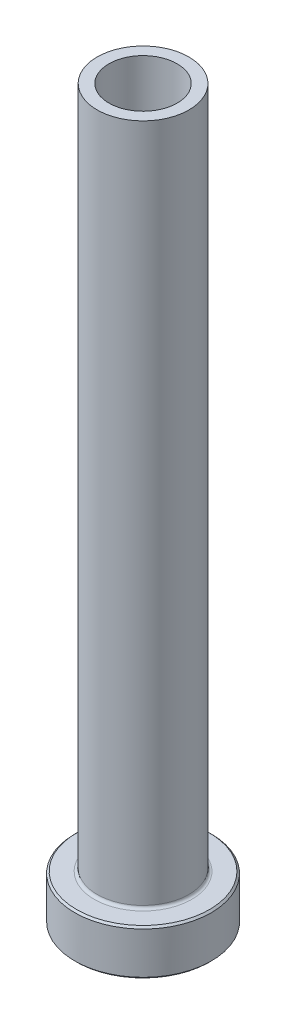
from build123d import *

# Parameters (mm, degrees)
CHAMFER1_SIZE = 0.254


with BuildPart() as part:
    # Sketch1 → Revolve1 (revolve)
    with BuildSketch(Plane.XY, mode=Mode.PRIVATE) as revolve1_sk:
        with BuildLine():
            Line((0, 0), (9.525, 0))
            Line((9.525, 0), (9.525, 6.35))
            Line((9.525, 6.35), (6.804025, 6.35))
            ThreePointArc((6.804025, 6.35), (6.523391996, 6.466241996), (6.40715, 6.746875))
            Line((6.40715, 6.746875), (6.40715, 101.6))
            Line((6.40715, 101.6), (0, 101.6))
            Line((0, 101.6), (0, 0))
        make_face()
    revolve(revolve1_sk.sketch.rotate(Axis((0, 0, 0), (0, 1, 0)), 90), axis=Axis((0, 0, 0), (0, 1, 0)))

    # Sketch2 → Cut-Revolve1 (revolve, cut)
    with BuildSketch(Plane.XY, mode=Mode.PRIVATE) as cut_revolve1_sk:
        Polygon((5.349875, 0), (4.953, 0.396875), (4.953, 27.1145), (4.7625, 41.402), (4.7625, 101.6), (0, 101.6), (0, 0), align=None)
    revolve(cut_revolve1_sk.sketch.rotate(Axis((0, 0, 0), (0, 1, 0)), 90), axis=Axis((0, 0, 0), (0, 1, 0)), mode=Mode.SUBTRACT)

    # Chamfer1
    chamfer1_edges = [part.edges().sort_by_distance(p)[0] for p in [
        (0, 6.35, 9.525),
        (0, 0, 9.525),
    ]]
    chamfer(chamfer1_edges, length=CHAMFER1_SIZE)


solid = part.part
